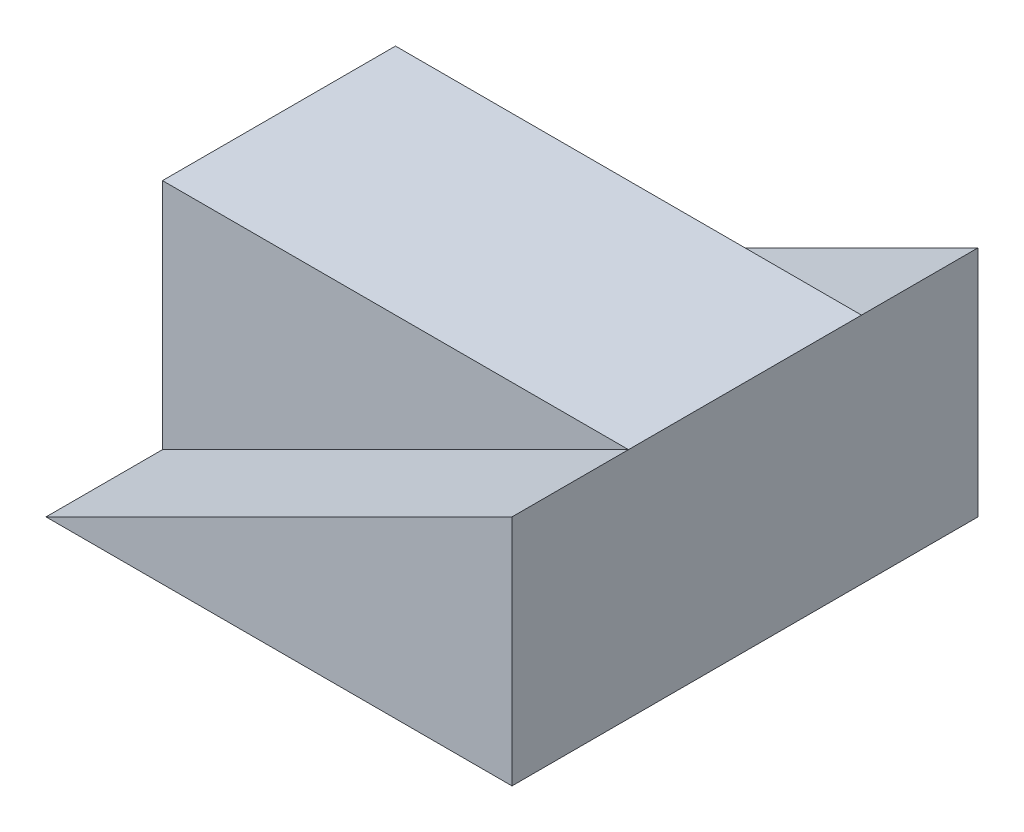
ISO-10303-21;
HEADER;
FILE_DESCRIPTION(('STEP AP214'),'2;1');
FILE_NAME('part.step','',(''),(''),'','','');
FILE_SCHEMA(('AUTOMOTIVE_DESIGN { 1 0 10303 214 1 1 1 1 }'));
ENDSEC;
DATA;
#1=APPLICATION_CONTEXT('core data for automotive mechanical design processes');
#2=APPLICATION_PROTOCOL_DEFINITION('international standard','automotive_design',2000,#1);
#3=PRODUCT_CONTEXT('',#1,'mechanical');
#4=PRODUCT('Part','Part','',(#3));
#5=PRODUCT_RELATED_PRODUCT_CATEGORY('part','',(#4));
#6=PRODUCT_DEFINITION_FORMATION('','',#4);
#7=PRODUCT_DEFINITION_CONTEXT('part definition',#1,'design');
#8=PRODUCT_DEFINITION('design','',#6,#7);
#9=PRODUCT_DEFINITION_SHAPE('','',#8);
#10=(LENGTH_UNIT() NAMED_UNIT(*) SI_UNIT(.MILLI.,.METRE.));
#11=(NAMED_UNIT(*) PLANE_ANGLE_UNIT() SI_UNIT($,.RADIAN.));
#12=(NAMED_UNIT(*) SI_UNIT($,.STERADIAN.) SOLID_ANGLE_UNIT());
#13=UNCERTAINTY_MEASURE_WITH_UNIT(LENGTH_MEASURE(1.E-05),#10,'distance_accuracy_value','');
#14=(GEOMETRIC_REPRESENTATION_CONTEXT(3) GLOBAL_UNCERTAINTY_ASSIGNED_CONTEXT((#13)) GLOBAL_UNIT_ASSIGNED_CONTEXT((#10,
#11,#12)) REPRESENTATION_CONTEXT('',''));
#15=CARTESIAN_POINT('',(0.,0.,0.));
#16=DIRECTION('',(0.,0.,1.));
#17=DIRECTION('',(1.,0.,0.));
#18=AXIS2_PLACEMENT_3D('',#15,#16,#17);
#19=CARTESIAN_POINT('',(-50.,25.,25.));
#20=DIRECTION('',(0.,0.,-1.));
#21=DIRECTION('',(-1.,0.,0.));
#22=AXIS2_PLACEMENT_3D('',#19,#20,#21);
#23=PLANE('',#22);
#24=DIRECTION('',(-0.894427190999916,-0.447213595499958,0.));
#25=VECTOR('',#24,1.);
#26=CARTESIAN_POINT('',(-30.,-15.,25.));
#27=LINE('',#26,#25);
#28=CARTESIAN_POINT('',(50.,25.,25.));
#29=VERTEX_POINT('',#28);
#30=CARTESIAN_POINT('',(-50.,-25.,25.));
#31=VERTEX_POINT('',#30);
#32=EDGE_CURVE('E52',#29,#31,#27,.T.);
#33=ORIENTED_EDGE('',*,*,#32,.F.);
#34=DIRECTION('',(-1.,0.,0.));
#35=VECTOR('',#34,1.);
#36=CARTESIAN_POINT('',(-50.,25.,25.));
#37=LINE('',#36,#35);
#38=CARTESIAN_POINT('',(-50.,25.,25.));
#39=VERTEX_POINT('',#38);
#40=EDGE_CURVE('E48',#29,#39,#37,.T.);
#41=ORIENTED_EDGE('',*,*,#40,.T.);
#42=DIRECTION('',(0.,-1.,0.));
#43=VECTOR('',#42,1.);
#44=CARTESIAN_POINT('',(-50.,-25.,25.));
#45=LINE('',#44,#43);
#46=EDGE_CURVE('E127',#39,#31,#45,.T.);
#47=ORIENTED_EDGE('',*,*,#46,.T.);
#48=EDGE_LOOP('',(#33,#41,#47));
#49=FACE_BOUND('',#48,.T.);
#50=ADVANCED_FACE('F33',(#49),#23,.F.);
#51=CARTESIAN_POINT('',(-50.,25.,-25.));
#52=DIRECTION('',(0.,0.,-1.));
#53=DIRECTION('',(-1.,0.,0.));
#54=AXIS2_PLACEMENT_3D('',#51,#52,#53);
#55=PLANE('',#54);
#56=DIRECTION('',(-1.,0.,0.));
#57=VECTOR('',#56,1.);
#58=CARTESIAN_POINT('',(-50.,25.,-25.));
#59=LINE('',#58,#57);
#60=CARTESIAN_POINT('',(50.,25.,-25.));
#61=VERTEX_POINT('',#60);
#62=CARTESIAN_POINT('',(-50.,25.,-25.));
#63=VERTEX_POINT('',#62);
#64=EDGE_CURVE('E125',#61,#63,#59,.T.);
#65=ORIENTED_EDGE('',*,*,#64,.F.);
#66=DIRECTION('',(-0.894427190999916,-0.447213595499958,0.));
#67=VECTOR('',#66,1.);
#68=CARTESIAN_POINT('',(-30.,-15.,-25.));
#69=LINE('',#68,#67);
#70=CARTESIAN_POINT('',(-50.,-25.,-25.));
#71=VERTEX_POINT('',#70);
#72=EDGE_CURVE('E11',#61,#71,#69,.T.);
#73=ORIENTED_EDGE('',*,*,#72,.T.);
#74=DIRECTION('',(0.,-1.,0.));
#75=VECTOR('',#74,1.);
#76=CARTESIAN_POINT('',(-50.,-25.,-25.));
#77=LINE('',#76,#75);
#78=EDGE_CURVE('E122',#63,#71,#77,.T.);
#79=ORIENTED_EDGE('',*,*,#78,.F.);
#80=EDGE_LOOP('',(#65,#73,#79));
#81=FACE_BOUND('',#80,.T.);
#82=ADVANCED_FACE('F146',(#81),#55,.T.);
#83=CARTESIAN_POINT('',(-50.,-25.,25.));
#84=DIRECTION('',(1.,0.,0.));
#85=DIRECTION('',(0.,0.,-1.));
#86=AXIS2_PLACEMENT_3D('',#83,#84,#85);
#87=PLANE('',#86);
#88=ORIENTED_EDGE('',*,*,#78,.T.);
#89=DIRECTION('',(0.,0.,-1.));
#90=VECTOR('',#89,1.);
#91=CARTESIAN_POINT('',(-50.,-25.,25.));
#92=LINE('',#91,#90);
#93=EDGE_CURVE('E41',#31,#71,#92,.T.);
#94=ORIENTED_EDGE('',*,*,#93,.F.);
#95=ORIENTED_EDGE('',*,*,#46,.F.);
#96=DIRECTION('',(0.,0.,-1.));
#97=VECTOR('',#96,1.);
#98=CARTESIAN_POINT('',(-50.,25.,25.));
#99=LINE('',#98,#97);
#100=EDGE_CURVE('E130',#39,#63,#99,.T.);
#101=ORIENTED_EDGE('',*,*,#100,.T.);
#102=EDGE_LOOP('',(#88,#94,#95,#101));
#103=FACE_BOUND('',#102,.T.);
#104=ADVANCED_FACE('F35',(#103),#87,.F.);
#105=CARTESIAN_POINT('',(-50.,-25.,25.));
#106=DIRECTION('',(0.,1.,0.));
#107=DIRECTION('',(0.,0.,1.));
#108=AXIS2_PLACEMENT_3D('',#105,#106,#107);
#109=PLANE('',#108);
#110=ORIENTED_EDGE('',*,*,#93,.T.);
#111=DIRECTION('',(0.,0.,-1.));
#112=VECTOR('',#111,1.);
#113=CARTESIAN_POINT('',(-50.,-25.,50.));
#114=LINE('',#113,#112);
#115=CARTESIAN_POINT('',(-50.,-25.,-50.));
#116=VERTEX_POINT('',#115);
#117=EDGE_CURVE('E117',#71,#116,#114,.T.);
#118=ORIENTED_EDGE('',*,*,#117,.T.);
#119=DIRECTION('',(1.,0.,0.));
#120=VECTOR('',#119,1.);
#121=CARTESIAN_POINT('',(-50.,-25.,-50.));
#122=LINE('',#121,#120);
#123=CARTESIAN_POINT('',(50.,-25.,-50.));
#124=VERTEX_POINT('',#123);
#125=EDGE_CURVE('E101',#116,#124,#122,.T.);
#126=ORIENTED_EDGE('',*,*,#125,.T.);
#127=DIRECTION('',(0.,0.,-1.));
#128=VECTOR('',#127,1.);
#129=CARTESIAN_POINT('',(50.,-25.,25.));
#130=LINE('',#129,#128);
#131=CARTESIAN_POINT('',(50.,-25.,50.));
#132=VERTEX_POINT('',#131);
#133=EDGE_CURVE('E105',#132,#124,#130,.T.);
#134=ORIENTED_EDGE('',*,*,#133,.F.);
#135=DIRECTION('',(1.,0.,0.));
#136=VECTOR('',#135,1.);
#137=CARTESIAN_POINT('',(-50.,-25.,50.));
#138=LINE('',#137,#136);
#139=CARTESIAN_POINT('',(-50.,-25.,50.));
#140=VERTEX_POINT('',#139);
#141=EDGE_CURVE('E114',#140,#132,#138,.T.);
#142=ORIENTED_EDGE('',*,*,#141,.F.);
#143=EDGE_CURVE('E94',#140,#31,#114,.T.);
#144=ORIENTED_EDGE('',*,*,#143,.T.);
#145=EDGE_LOOP('',(#110,#118,#126,#134,#142,#144));
#146=FACE_BOUND('',#145,.T.);
#147=ADVANCED_FACE('F138',(#146),#109,.F.);
#148=CARTESIAN_POINT('',(50.,-25.,25.));
#149=DIRECTION('',(-1.,0.,0.));
#150=DIRECTION('',(0.,0.,1.));
#151=AXIS2_PLACEMENT_3D('',#148,#149,#150);
#152=PLANE('',#151);
#153=ORIENTED_EDGE('',*,*,#133,.T.);
#154=DIRECTION('',(0.,1.,0.));
#155=VECTOR('',#154,1.);
#156=CARTESIAN_POINT('',(50.,-25.,-50.));
#157=LINE('',#156,#155);
#158=CARTESIAN_POINT('',(50.,25.,-50.));
#159=VERTEX_POINT('',#158);
#160=EDGE_CURVE('E99',#124,#159,#157,.T.);
#161=ORIENTED_EDGE('',*,*,#160,.T.);
#162=DIRECTION('',(0.,0.,-1.));
#163=VECTOR('',#162,1.);
#164=CARTESIAN_POINT('',(50.,25.,50.));
#165=LINE('',#164,#163);
#166=EDGE_CURVE('E85',#61,#159,#165,.T.);
#167=ORIENTED_EDGE('',*,*,#166,.F.);
#168=DIRECTION('',(0.,0.,-1.));
#169=VECTOR('',#168,1.);
#170=CARTESIAN_POINT('',(50.,25.,25.));
#171=LINE('',#170,#169);
#172=EDGE_CURVE('E133',#29,#61,#171,.T.);
#173=ORIENTED_EDGE('',*,*,#172,.F.);
#174=CARTESIAN_POINT('',(50.,25.,50.));
#175=VERTEX_POINT('',#174);
#176=EDGE_CURVE('E93',#175,#29,#165,.T.);
#177=ORIENTED_EDGE('',*,*,#176,.F.);
#178=DIRECTION('',(0.,1.,0.));
#179=VECTOR('',#178,1.);
#180=CARTESIAN_POINT('',(50.,-25.,50.));
#181=LINE('',#180,#179);
#182=EDGE_CURVE('E109',#132,#175,#181,.T.);
#183=ORIENTED_EDGE('',*,*,#182,.F.);
#184=EDGE_LOOP('',(#153,#161,#167,#173,#177,#183));
#185=FACE_BOUND('',#184,.T.);
#186=ADVANCED_FACE('F103',(#185),#152,.F.);
#187=CARTESIAN_POINT('',(-50.,25.,25.));
#188=DIRECTION('',(0.,-1.,0.));
#189=DIRECTION('',(0.,0.,-1.));
#190=AXIS2_PLACEMENT_3D('',#187,#188,#189);
#191=PLANE('',#190);
#192=ORIENTED_EDGE('',*,*,#64,.T.);
#193=ORIENTED_EDGE('',*,*,#100,.F.);
#194=ORIENTED_EDGE('',*,*,#40,.F.);
#195=ORIENTED_EDGE('',*,*,#172,.T.);
#196=EDGE_LOOP('',(#192,#193,#194,#195));
#197=FACE_BOUND('',#196,.T.);
#198=ADVANCED_FACE('F148',(#197),#191,.F.);
#199=CARTESIAN_POINT('',(50.,-25.,-50.));
#200=DIRECTION('',(0.,0.,-1.));
#201=DIRECTION('',(-1.,0.,0.));
#202=AXIS2_PLACEMENT_3D('',#199,#200,#201);
#203=PLANE('',#202);
#204=ORIENTED_EDGE('',*,*,#160,.F.);
#205=ORIENTED_EDGE('',*,*,#125,.F.);
#206=DIRECTION('',(-0.894427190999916,-0.447213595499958,0.));
#207=VECTOR('',#206,1.);
#208=CARTESIAN_POINT('',(50.,25.,-50.));
#209=LINE('',#208,#207);
#210=EDGE_CURVE('E88',#159,#116,#209,.T.);
#211=ORIENTED_EDGE('',*,*,#210,.F.);
#212=EDGE_LOOP('',(#204,#205,#211));
#213=FACE_BOUND('',#212,.T.);
#214=ADVANCED_FACE('F98',(#213),#203,.T.);
#215=CARTESIAN_POINT('',(50.,25.,50.));
#216=DIRECTION('',(0.447213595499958,-0.894427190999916,0.));
#217=DIRECTION('',(0.894427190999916,0.447213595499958,0.));
#218=AXIS2_PLACEMENT_3D('',#215,#216,#217);
#219=PLANE('',#218);
#220=ORIENTED_EDGE('',*,*,#72,.F.);
#221=ORIENTED_EDGE('',*,*,#166,.T.);
#222=ORIENTED_EDGE('',*,*,#210,.T.);
#223=ORIENTED_EDGE('',*,*,#117,.F.);
#224=EDGE_LOOP('',(#220,#221,#222,#223));
#225=FACE_BOUND('',#224,.T.);
#226=ADVANCED_FACE('F87',(#225),#219,.F.);
#227=ORIENTED_EDGE('',*,*,#176,.T.);
#228=ORIENTED_EDGE('',*,*,#32,.T.);
#229=ORIENTED_EDGE('',*,*,#143,.F.);
#230=DIRECTION('',(-0.894427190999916,-0.447213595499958,0.));
#231=VECTOR('',#230,1.);
#232=CARTESIAN_POINT('',(50.,25.,50.));
#233=LINE('',#232,#231);
#234=EDGE_CURVE('E112',#175,#140,#233,.T.);
#235=ORIENTED_EDGE('',*,*,#234,.F.);
#236=EDGE_LOOP('',(#227,#228,#229,#235));
#237=FACE_BOUND('',#236,.T.);
#238=ADVANCED_FACE('F151',(#237),#219,.F.);
#239=CARTESIAN_POINT('',(50.,-25.,50.));
#240=DIRECTION('',(0.,0.,-1.));
#241=DIRECTION('',(-1.,0.,0.));
#242=AXIS2_PLACEMENT_3D('',#239,#240,#241);
#243=PLANE('',#242);
#244=ORIENTED_EDGE('',*,*,#182,.T.);
#245=ORIENTED_EDGE('',*,*,#234,.T.);
#246=ORIENTED_EDGE('',*,*,#141,.T.);
#247=EDGE_LOOP('',(#244,#245,#246));
#248=FACE_BOUND('',#247,.T.);
#249=ADVANCED_FACE('F153',(#248),#243,.F.);
#250=CLOSED_SHELL('',(#50,#82,#104,#147,#186,#198,#214,#226,#238,#249));
#251=MANIFOLD_SOLID_BREP('B2',#250);
#252=ADVANCED_BREP_SHAPE_REPRESENTATION('',(#18,#251),#14);
#253=SHAPE_DEFINITION_REPRESENTATION(#9,#252);
ENDSEC;
END-ISO-10303-21;
